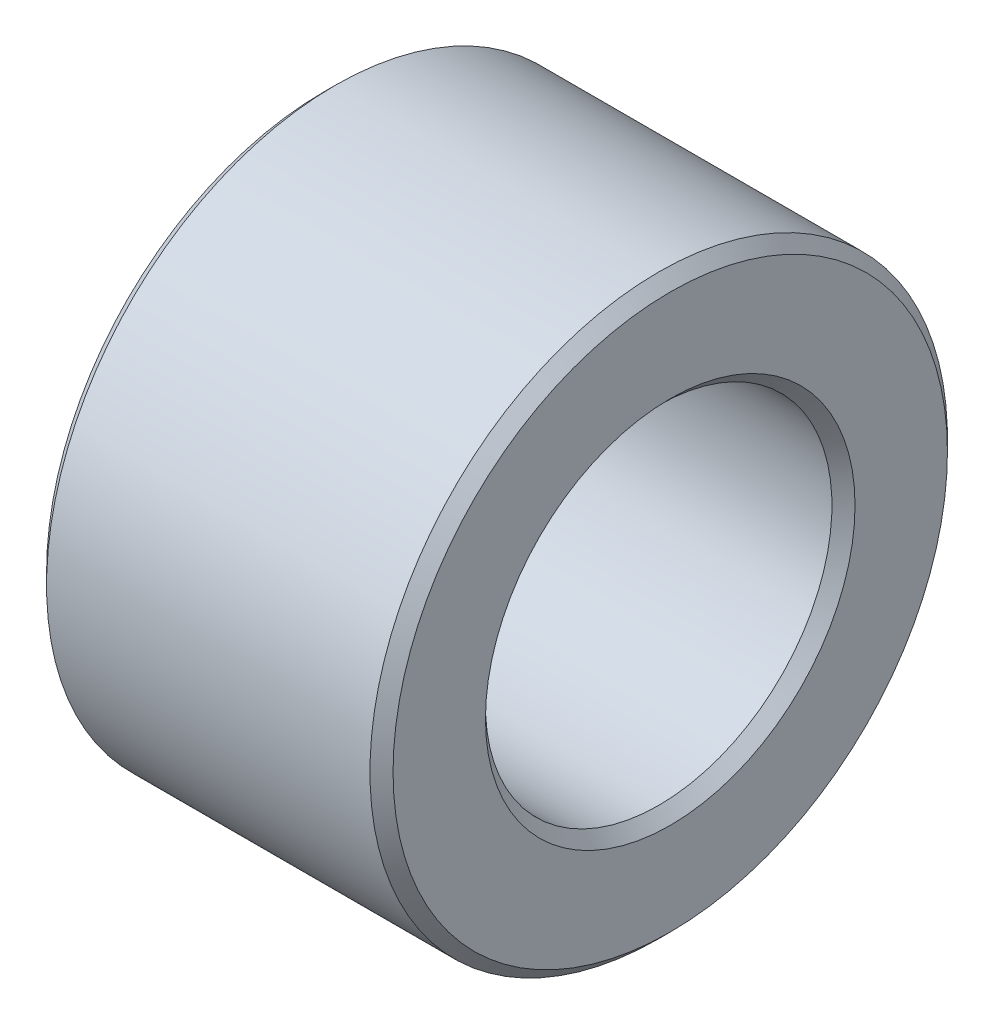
ISO-10303-21;
HEADER;
FILE_DESCRIPTION(('STEP AP214'),'2;1');
FILE_NAME('part.step','',(''),(''),'','','');
FILE_SCHEMA(('AUTOMOTIVE_DESIGN { 1 0 10303 214 1 1 1 1 }'));
ENDSEC;
DATA;
#1=APPLICATION_CONTEXT('core data for automotive mechanical design processes');
#2=APPLICATION_PROTOCOL_DEFINITION('international standard','automotive_design',2000,#1);
#3=PRODUCT_CONTEXT('',#1,'mechanical');
#4=PRODUCT('Part','Part','',(#3));
#5=PRODUCT_RELATED_PRODUCT_CATEGORY('part','',(#4));
#6=PRODUCT_DEFINITION_FORMATION('','',#4);
#7=PRODUCT_DEFINITION_CONTEXT('part definition',#1,'design');
#8=PRODUCT_DEFINITION('design','',#6,#7);
#9=PRODUCT_DEFINITION_SHAPE('','',#8);
#10=(LENGTH_UNIT() NAMED_UNIT(*) SI_UNIT(.MILLI.,.METRE.));
#11=(NAMED_UNIT(*) PLANE_ANGLE_UNIT() SI_UNIT($,.RADIAN.));
#12=(NAMED_UNIT(*) SI_UNIT($,.STERADIAN.) SOLID_ANGLE_UNIT());
#13=UNCERTAINTY_MEASURE_WITH_UNIT(LENGTH_MEASURE(1.E-05),#10,'distance_accuracy_value','');
#14=(GEOMETRIC_REPRESENTATION_CONTEXT(3) GLOBAL_UNCERTAINTY_ASSIGNED_CONTEXT((#13)) GLOBAL_UNIT_ASSIGNED_CONTEXT((#10,
#11,#12)) REPRESENTATION_CONTEXT('',''));
#15=CARTESIAN_POINT('',(0.,0.,0.));
#16=DIRECTION('',(0.,0.,1.));
#17=DIRECTION('',(1.,0.,0.));
#18=AXIS2_PLACEMENT_3D('',#15,#16,#17);
#19=CARTESIAN_POINT('',(0.,-8.,0.));
#20=DIRECTION('',(-1.,0.,0.));
#21=DIRECTION('',(0.,1.,0.));
#22=AXIS2_PLACEMENT_3D('',#19,#20,#21);
#23=PLANE('',#22);
#24=CARTESIAN_POINT('',(0.,0.,0.));
#25=DIRECTION('',(1.,0.,0.));
#26=DIRECTION('',(0.,-1.,0.));
#27=AXIS2_PLACEMENT_3D('',#24,#25,#26);
#28=CIRCLE('',#27,6.4);
#29=CARTESIAN_POINT('',(0.,-6.4,0.));
#30=VERTEX_POINT('',#29);
#31=EDGE_CURVE('E9',#30,#30,#28,.T.);
#32=ORIENTED_EDGE('',*,*,#31,.T.);
#33=EDGE_LOOP('',(#32));
#34=FACE_BOUND('',#33,.T.);
#35=CARTESIAN_POINT('',(0.,0.,0.));
#36=DIRECTION('',(1.,0.,0.));
#37=DIRECTION('',(0.,-1.,0.));
#38=AXIS2_PLACEMENT_3D('',#35,#36,#37);
#39=CIRCLE('',#38,9.6);
#40=CARTESIAN_POINT('',(0.,-9.6,0.));
#41=VERTEX_POINT('',#40);
#42=EDGE_CURVE('E53',#41,#41,#39,.T.);
#43=ORIENTED_EDGE('',*,*,#42,.F.);
#44=EDGE_LOOP('',(#43));
#45=FACE_BOUND('',#44,.T.);
#46=ADVANCED_FACE('F15',(#34,#45),#23,.T.);
#47=CARTESIAN_POINT('',(0.2,0.,0.));
#48=DIRECTION('',(-1.,0.,0.));
#49=DIRECTION('',(0.,-1.,0.));
#50=AXIS2_PLACEMENT_3D('',#47,#48,#49);
#51=CONICAL_SURFACE('',#50,6.2,0.785398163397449);
#52=CARTESIAN_POINT('',(0.4,0.,0.));
#53=DIRECTION('',(1.,0.,0.));
#54=DIRECTION('',(0.,-1.,0.));
#55=AXIS2_PLACEMENT_3D('',#52,#53,#54);
#56=CIRCLE('',#55,6.);
#57=CARTESIAN_POINT('',(0.4,-6.,0.));
#58=VERTEX_POINT('',#57);
#59=EDGE_CURVE('E22',#58,#58,#56,.T.);
#60=ORIENTED_EDGE('',*,*,#59,.T.);
#61=EDGE_LOOP('',(#60));
#62=FACE_BOUND('',#61,.T.);
#63=ORIENTED_EDGE('',*,*,#31,.F.);
#64=EDGE_LOOP('',(#63));
#65=FACE_BOUND('',#64,.T.);
#66=ADVANCED_FACE('F82',(#62,#65),#51,.F.);
#67=CARTESIAN_POINT('',(6.,0.,0.));
#68=DIRECTION('',(-1.,0.,0.));
#69=DIRECTION('',(0.,-1.,0.));
#70=AXIS2_PLACEMENT_3D('',#67,#68,#69);
#71=CYLINDRICAL_SURFACE('',#70,6.);
#72=CARTESIAN_POINT('',(11.6,0.,0.));
#73=DIRECTION('',(1.,0.,0.));
#74=DIRECTION('',(0.,-1.,0.));
#75=AXIS2_PLACEMENT_3D('',#72,#73,#74);
#76=CIRCLE('',#75,6.);
#77=CARTESIAN_POINT('',(11.6,-6.,0.));
#78=VERTEX_POINT('',#77);
#79=EDGE_CURVE('E58',#78,#78,#76,.T.);
#80=ORIENTED_EDGE('',*,*,#79,.T.);
#81=EDGE_LOOP('',(#80));
#82=FACE_BOUND('',#81,.T.);
#83=ORIENTED_EDGE('',*,*,#59,.F.);
#84=EDGE_LOOP('',(#83));
#85=FACE_BOUND('',#84,.T.);
#86=ADVANCED_FACE('F66',(#82,#85),#71,.F.);
#87=CARTESIAN_POINT('',(11.8,0.,0.));
#88=DIRECTION('',(1.,0.,0.));
#89=DIRECTION('',(0.,-1.,0.));
#90=AXIS2_PLACEMENT_3D('',#87,#88,#89);
#91=CONICAL_SURFACE('',#90,6.2,0.785398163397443);
#92=CARTESIAN_POINT('',(12.,0.,0.));
#93=DIRECTION('',(1.,0.,0.));
#94=DIRECTION('',(0.,-1.,0.));
#95=AXIS2_PLACEMENT_3D('',#92,#93,#94);
#96=CIRCLE('',#95,6.4);
#97=CARTESIAN_POINT('',(12.,-6.4,0.));
#98=VERTEX_POINT('',#97);
#99=EDGE_CURVE('E63',#98,#98,#96,.T.);
#100=ORIENTED_EDGE('',*,*,#99,.T.);
#101=EDGE_LOOP('',(#100));
#102=FACE_BOUND('',#101,.T.);
#103=ORIENTED_EDGE('',*,*,#79,.F.);
#104=EDGE_LOOP('',(#103));
#105=FACE_BOUND('',#104,.T.);
#106=ADVANCED_FACE('F69',(#102,#105),#91,.F.);
#107=CARTESIAN_POINT('',(12.,-8.,0.));
#108=DIRECTION('',(1.,0.,0.));
#109=DIRECTION('',(0.,-1.,0.));
#110=AXIS2_PLACEMENT_3D('',#107,#108,#109);
#111=PLANE('',#110);
#112=CARTESIAN_POINT('',(12.,0.,0.));
#113=DIRECTION('',(1.,0.,0.));
#114=DIRECTION('',(0.,-1.,0.));
#115=AXIS2_PLACEMENT_3D('',#112,#113,#114);
#116=CIRCLE('',#115,9.6);
#117=CARTESIAN_POINT('',(12.,-9.6,0.));
#118=VERTEX_POINT('',#117);
#119=EDGE_CURVE('E61',#118,#118,#116,.T.);
#120=ORIENTED_EDGE('',*,*,#119,.T.);
#121=EDGE_LOOP('',(#120));
#122=FACE_BOUND('',#121,.T.);
#123=ORIENTED_EDGE('',*,*,#99,.F.);
#124=EDGE_LOOP('',(#123));
#125=FACE_BOUND('',#124,.T.);
#126=ADVANCED_FACE('F71',(#122,#125),#111,.T.);
#127=CARTESIAN_POINT('',(11.8,0.,0.));
#128=DIRECTION('',(-1.,0.,0.));
#129=DIRECTION('',(0.,-1.,0.));
#130=AXIS2_PLACEMENT_3D('',#127,#128,#129);
#131=CONICAL_SURFACE('',#130,9.8,0.785398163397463);
#132=CARTESIAN_POINT('',(11.6,0.,0.));
#133=DIRECTION('',(1.,0.,0.));
#134=DIRECTION('',(0.,-1.,0.));
#135=AXIS2_PLACEMENT_3D('',#132,#133,#134);
#136=CIRCLE('',#135,10.);
#137=CARTESIAN_POINT('',(11.6,-10.,0.));
#138=VERTEX_POINT('',#137);
#139=EDGE_CURVE('E55',#138,#138,#136,.T.);
#140=ORIENTED_EDGE('',*,*,#139,.T.);
#141=EDGE_LOOP('',(#140));
#142=FACE_BOUND('',#141,.T.);
#143=ORIENTED_EDGE('',*,*,#119,.F.);
#144=EDGE_LOOP('',(#143));
#145=FACE_BOUND('',#144,.T.);
#146=ADVANCED_FACE('F79',(#142,#145),#131,.T.);
#147=CARTESIAN_POINT('',(6.,0.,0.));
#148=DIRECTION('',(-1.,0.,0.));
#149=DIRECTION('',(0.,-1.,0.));
#150=AXIS2_PLACEMENT_3D('',#147,#148,#149);
#151=CYLINDRICAL_SURFACE('',#150,10.);
#152=CARTESIAN_POINT('',(0.4,0.,0.));
#153=DIRECTION('',(1.,0.,0.));
#154=DIRECTION('',(0.,-1.,0.));
#155=AXIS2_PLACEMENT_3D('',#152,#153,#154);
#156=CIRCLE('',#155,10.);
#157=CARTESIAN_POINT('',(0.4,-10.,0.));
#158=VERTEX_POINT('',#157);
#159=EDGE_CURVE('E49',#158,#158,#156,.T.);
#160=ORIENTED_EDGE('',*,*,#159,.T.);
#161=EDGE_LOOP('',(#160));
#162=FACE_BOUND('',#161,.T.);
#163=ORIENTED_EDGE('',*,*,#139,.F.);
#164=EDGE_LOOP('',(#163));
#165=FACE_BOUND('',#164,.T.);
#166=ADVANCED_FACE('F50',(#162,#165),#151,.T.);
#167=CARTESIAN_POINT('',(0.2,0.,0.));
#168=DIRECTION('',(1.,0.,0.));
#169=DIRECTION('',(0.,-1.,0.));
#170=AXIS2_PLACEMENT_3D('',#167,#168,#169);
#171=CONICAL_SURFACE('',#170,9.8,0.785398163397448);
#172=ORIENTED_EDGE('',*,*,#42,.T.);
#173=EDGE_LOOP('',(#172));
#174=FACE_BOUND('',#173,.T.);
#175=ORIENTED_EDGE('',*,*,#159,.F.);
#176=EDGE_LOOP('',(#175));
#177=FACE_BOUND('',#176,.T.);
#178=ADVANCED_FACE('F92',(#174,#177),#171,.T.);
#179=CLOSED_SHELL('',(#46,#66,#86,#106,#126,#146,#166,#178));
#180=MANIFOLD_SOLID_BREP('B1',#179);
#181=ADVANCED_BREP_SHAPE_REPRESENTATION('',(#18,#180),#14);
#182=SHAPE_DEFINITION_REPRESENTATION(#9,#181);
ENDSEC;
END-ISO-10303-21;
